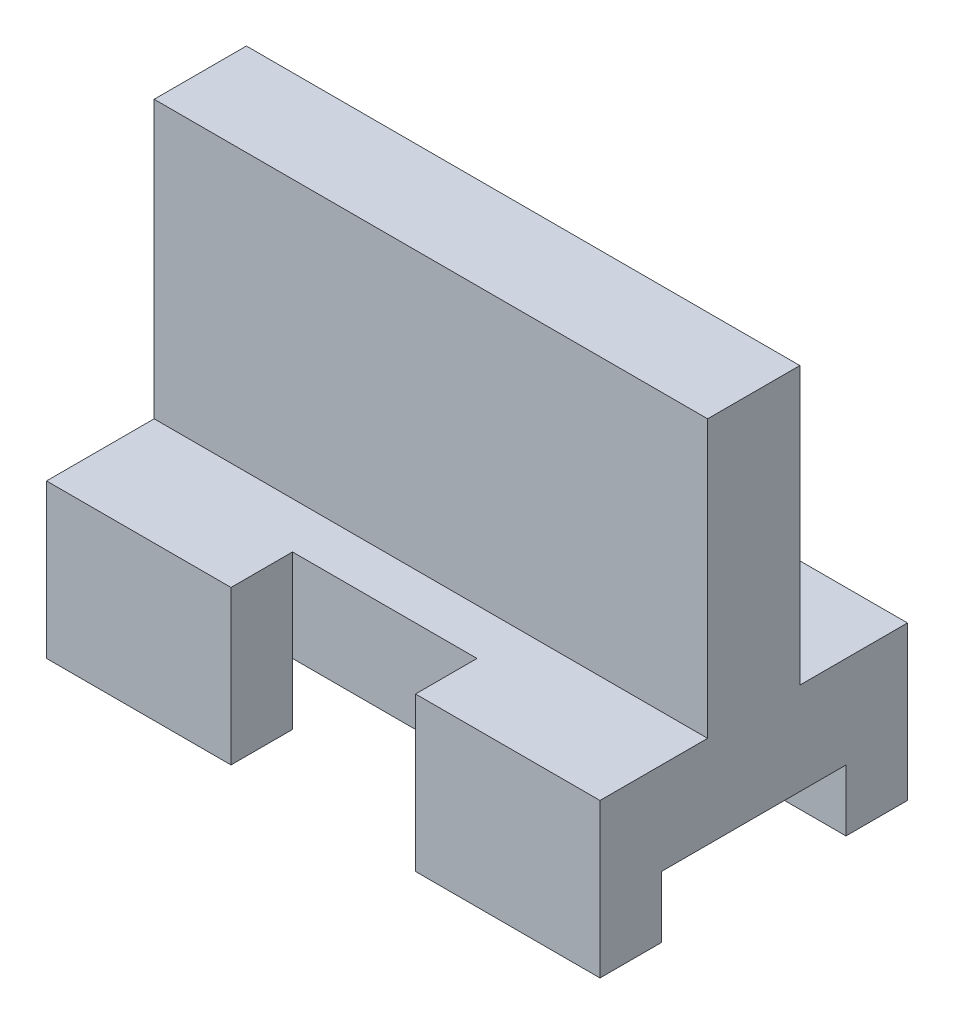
ISO-10303-21;
HEADER;
FILE_DESCRIPTION(('STEP AP214'),'2;1');
FILE_NAME('part.step','',(''),(''),'','','');
FILE_SCHEMA(('AUTOMOTIVE_DESIGN { 1 0 10303 214 1 1 1 1 }'));
ENDSEC;
DATA;
#1=APPLICATION_CONTEXT('core data for automotive mechanical design processes');
#2=APPLICATION_PROTOCOL_DEFINITION('international standard','automotive_design',2000,#1);
#3=PRODUCT_CONTEXT('',#1,'mechanical');
#4=PRODUCT('Part','Part','',(#3));
#5=PRODUCT_RELATED_PRODUCT_CATEGORY('part','',(#4));
#6=PRODUCT_DEFINITION_FORMATION('','',#4);
#7=PRODUCT_DEFINITION_CONTEXT('part definition',#1,'design');
#8=PRODUCT_DEFINITION('design','',#6,#7);
#9=PRODUCT_DEFINITION_SHAPE('','',#8);
#10=(LENGTH_UNIT() NAMED_UNIT(*) SI_UNIT(.MILLI.,.METRE.));
#11=(NAMED_UNIT(*) PLANE_ANGLE_UNIT() SI_UNIT($,.RADIAN.));
#12=(NAMED_UNIT(*) SI_UNIT($,.STERADIAN.) SOLID_ANGLE_UNIT());
#13=UNCERTAINTY_MEASURE_WITH_UNIT(LENGTH_MEASURE(1.E-05),#10,'distance_accuracy_value','');
#14=(GEOMETRIC_REPRESENTATION_CONTEXT(3) GLOBAL_UNCERTAINTY_ASSIGNED_CONTEXT((#13)) GLOBAL_UNIT_ASSIGNED_CONTEXT((#10,
#11,#12)) REPRESENTATION_CONTEXT('',''));
#15=CARTESIAN_POINT('',(0.,0.,0.));
#16=DIRECTION('',(0.,0.,1.));
#17=DIRECTION('',(1.,0.,0.));
#18=AXIS2_PLACEMENT_3D('',#15,#16,#17);
#19=CARTESIAN_POINT('',(0.,0.,-50.));
#20=DIRECTION('',(0.,-1.,0.));
#21=DIRECTION('',(0.,0.,-1.));
#22=AXIS2_PLACEMENT_3D('',#19,#20,#21);
#23=PLANE('',#22);
#24=DIRECTION('',(1.,0.,0.));
#25=VECTOR('',#24,1.);
#26=CARTESIAN_POINT('',(-5.00000000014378E-05,0.,-10.));
#27=LINE('',#26,#25);
#28=CARTESIAN_POINT('',(60.,0.,-10.));
#29=VERTEX_POINT('',#28);
#30=CARTESIAN_POINT('',(90.,0.,-10.));
#31=VERTEX_POINT('',#30);
#32=EDGE_CURVE('E184',#29,#31,#27,.T.);
#33=ORIENTED_EDGE('',*,*,#32,.T.);
#34=DIRECTION('',(0.,0.,-1.));
#35=VECTOR('',#34,1.);
#36=CARTESIAN_POINT('',(90.,0.,0.));
#37=LINE('',#36,#35);
#38=CARTESIAN_POINT('',(90.,0.,0.));
#39=VERTEX_POINT('',#38);
#40=EDGE_CURVE('E198',#39,#31,#37,.T.);
#41=ORIENTED_EDGE('',*,*,#40,.F.);
#42=DIRECTION('',(1.,0.,0.));
#43=VECTOR('',#42,1.);
#44=CARTESIAN_POINT('',(0.,0.,0.));
#45=LINE('',#44,#43);
#46=CARTESIAN_POINT('',(60.,0.,0.));
#47=VERTEX_POINT('',#46);
#48=EDGE_CURVE('E376',#47,#39,#45,.T.);
#49=ORIENTED_EDGE('',*,*,#48,.F.);
#50=DIRECTION('',(0.,0.,-1.));
#51=VECTOR('',#50,1.);
#52=CARTESIAN_POINT('',(60.,0.,0.));
#53=LINE('',#52,#51);
#54=EDGE_CURVE('E199',#47,#29,#53,.T.);
#55=ORIENTED_EDGE('',*,*,#54,.T.);
#56=EDGE_LOOP('',(#33,#41,#49,#55));
#57=FACE_BOUND('',#56,.T.);
#58=ADVANCED_FACE('F31',(#57),#23,.T.);
#59=CARTESIAN_POINT('',(0.,0.,-10.));
#60=VERTEX_POINT('',#59);
#61=CARTESIAN_POINT('',(30.,0.,-10.));
#62=VERTEX_POINT('',#61);
#63=EDGE_CURVE('E200',#60,#62,#27,.T.);
#64=ORIENTED_EDGE('',*,*,#63,.T.);
#65=DIRECTION('',(0.,0.,1.));
#66=VECTOR('',#65,1.);
#67=CARTESIAN_POINT('',(30.,0.,0.));
#68=LINE('',#67,#66);
#69=CARTESIAN_POINT('',(30.,0.,0.));
#70=VERTEX_POINT('',#69);
#71=EDGE_CURVE('E285',#62,#70,#68,.T.);
#72=ORIENTED_EDGE('',*,*,#71,.T.);
#73=CARTESIAN_POINT('',(0.,0.,0.));
#74=VERTEX_POINT('',#73);
#75=EDGE_CURVE('E212',#74,#70,#45,.T.);
#76=ORIENTED_EDGE('',*,*,#75,.F.);
#77=DIRECTION('',(0.,0.,1.));
#78=VECTOR('',#77,1.);
#79=CARTESIAN_POINT('',(0.,0.,0.));
#80=LINE('',#79,#78);
#81=EDGE_CURVE('E327',#60,#74,#80,.T.);
#82=ORIENTED_EDGE('',*,*,#81,.F.);
#83=EDGE_LOOP('',(#64,#72,#76,#82));
#84=FACE_BOUND('',#83,.T.);
#85=ADVANCED_FACE('F446',(#84),#23,.T.);
#86=DIRECTION('',(1.,0.,0.));
#87=VECTOR('',#86,1.);
#88=CARTESIAN_POINT('',(-5.00000000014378E-05,0.,-40.));
#89=LINE('',#88,#87);
#90=CARTESIAN_POINT('',(0.,0.,-40.));
#91=VERTEX_POINT('',#90);
#92=CARTESIAN_POINT('',(30.,0.,-40.));
#93=VERTEX_POINT('',#92);
#94=EDGE_CURVE('E48',#91,#93,#89,.T.);
#95=ORIENTED_EDGE('',*,*,#94,.F.);
#96=CARTESIAN_POINT('',(0.,0.,-50.));
#97=VERTEX_POINT('',#96);
#98=EDGE_CURVE('E377',#97,#91,#80,.T.);
#99=ORIENTED_EDGE('',*,*,#98,.F.);
#100=DIRECTION('',(-1.,0.,0.));
#101=VECTOR('',#100,1.);
#102=CARTESIAN_POINT('',(0.,0.,-50.));
#103=LINE('',#102,#101);
#104=CARTESIAN_POINT('',(30.,0.,-50.));
#105=VERTEX_POINT('',#104);
#106=EDGE_CURVE('E207',#105,#97,#103,.T.);
#107=ORIENTED_EDGE('',*,*,#106,.F.);
#108=DIRECTION('',(0.,0.,1.));
#109=VECTOR('',#108,1.);
#110=CARTESIAN_POINT('',(30.,0.,-50.));
#111=LINE('',#110,#109);
#112=EDGE_CURVE('E388',#105,#93,#111,.T.);
#113=ORIENTED_EDGE('',*,*,#112,.T.);
#114=EDGE_LOOP('',(#95,#99,#107,#113));
#115=FACE_BOUND('',#114,.T.);
#116=ADVANCED_FACE('F386',(#115),#23,.T.);
#117=CARTESIAN_POINT('',(0.,25.,-50.));
#118=DIRECTION('',(0.,0.,1.));
#119=DIRECTION('',(1.,0.,0.));
#120=AXIS2_PLACEMENT_3D('',#117,#118,#119);
#121=PLANE('',#120);
#122=CARTESIAN_POINT('',(90.,0.,-50.));
#123=VERTEX_POINT('',#122);
#124=CARTESIAN_POINT('',(60.,0.,-50.));
#125=VERTEX_POINT('',#124);
#126=EDGE_CURVE('E210',#123,#125,#103,.T.);
#127=ORIENTED_EDGE('',*,*,#126,.T.);
#128=DIRECTION('',(0.,1.,0.));
#129=VECTOR('',#128,1.);
#130=CARTESIAN_POINT('',(60.,0.,-50.));
#131=LINE('',#130,#129);
#132=CARTESIAN_POINT('',(60.,25.,-50.));
#133=VERTEX_POINT('',#132);
#134=EDGE_CURVE('E263',#125,#133,#131,.T.);
#135=ORIENTED_EDGE('',*,*,#134,.T.);
#136=DIRECTION('',(-1.,0.,0.));
#137=VECTOR('',#136,1.);
#138=CARTESIAN_POINT('',(0.,25.,-50.));
#139=LINE('',#138,#137);
#140=CARTESIAN_POINT('',(90.,25.,-50.));
#141=VERTEX_POINT('',#140);
#142=EDGE_CURVE('E222',#141,#133,#139,.T.);
#143=ORIENTED_EDGE('',*,*,#142,.F.);
#144=DIRECTION('',(0.,-1.,0.));
#145=VECTOR('',#144,1.);
#146=CARTESIAN_POINT('',(90.,25.,-50.));
#147=LINE('',#146,#145);
#148=EDGE_CURVE('E221',#141,#123,#147,.T.);
#149=ORIENTED_EDGE('',*,*,#148,.T.);
#150=EDGE_LOOP('',(#127,#135,#143,#149));
#151=FACE_BOUND('',#150,.T.);
#152=ADVANCED_FACE('F262',(#151),#121,.F.);
#153=CARTESIAN_POINT('',(0.,25.,0.));
#154=DIRECTION('',(0.,0.,-1.));
#155=DIRECTION('',(-1.,0.,0.));
#156=AXIS2_PLACEMENT_3D('',#153,#154,#155);
#157=PLANE('',#156);
#158=ORIENTED_EDGE('',*,*,#75,.T.);
#159=DIRECTION('',(0.,1.,0.));
#160=VECTOR('',#159,1.);
#161=CARTESIAN_POINT('',(30.,0.,0.));
#162=LINE('',#161,#160);
#163=CARTESIAN_POINT('',(30.,25.,0.));
#164=VERTEX_POINT('',#163);
#165=EDGE_CURVE('E289',#70,#164,#162,.T.);
#166=ORIENTED_EDGE('',*,*,#165,.T.);
#167=DIRECTION('',(1.,0.,0.));
#168=VECTOR('',#167,1.);
#169=CARTESIAN_POINT('',(0.,25.,0.));
#170=LINE('',#169,#168);
#171=CARTESIAN_POINT('',(0.,25.,0.));
#172=VERTEX_POINT('',#171);
#173=EDGE_CURVE('E236',#172,#164,#170,.T.);
#174=ORIENTED_EDGE('',*,*,#173,.F.);
#175=DIRECTION('',(0.,-1.,0.));
#176=VECTOR('',#175,1.);
#177=CARTESIAN_POINT('',(0.,25.,0.));
#178=LINE('',#177,#176);
#179=EDGE_CURVE('E11',#172,#74,#178,.T.);
#180=ORIENTED_EDGE('',*,*,#179,.T.);
#181=EDGE_LOOP('',(#158,#166,#174,#180));
#182=FACE_BOUND('',#181,.T.);
#183=ADVANCED_FACE('F357',(#182),#157,.F.);
#184=CARTESIAN_POINT('',(0.,25.,-50.));
#185=DIRECTION('',(0.,-1.,0.));
#186=DIRECTION('',(0.,0.,-1.));
#187=AXIS2_PLACEMENT_3D('',#184,#185,#186);
#188=PLANE('',#187);
#189=ORIENTED_EDGE('',*,*,#142,.T.);
#190=DIRECTION('',(0.,0.,-1.));
#191=VECTOR('',#190,1.);
#192=CARTESIAN_POINT('',(60.,25.,-50.));
#193=LINE('',#192,#191);
#194=CARTESIAN_POINT('',(60.,25.,-40.));
#195=VERTEX_POINT('',#194);
#196=EDGE_CURVE('E276',#195,#133,#193,.T.);
#197=ORIENTED_EDGE('',*,*,#196,.F.);
#198=DIRECTION('',(1.,0.,0.));
#199=VECTOR('',#198,1.);
#200=CARTESIAN_POINT('',(30.,25.,-40.));
#201=LINE('',#200,#199);
#202=CARTESIAN_POINT('',(30.,25.,-40.));
#203=VERTEX_POINT('',#202);
#204=EDGE_CURVE('E407',#203,#195,#201,.T.);
#205=ORIENTED_EDGE('',*,*,#204,.F.);
#206=DIRECTION('',(0.,0.,1.));
#207=VECTOR('',#206,1.);
#208=CARTESIAN_POINT('',(30.,25.,-50.));
#209=LINE('',#208,#207);
#210=CARTESIAN_POINT('',(30.,25.,-50.));
#211=VERTEX_POINT('',#210);
#212=EDGE_CURVE('E403',#211,#203,#209,.T.);
#213=ORIENTED_EDGE('',*,*,#212,.F.);
#214=CARTESIAN_POINT('',(0.,25.,-50.));
#215=VERTEX_POINT('',#214);
#216=EDGE_CURVE('E247',#211,#215,#139,.T.);
#217=ORIENTED_EDGE('',*,*,#216,.T.);
#218=DIRECTION('',(0.,0.,1.));
#219=VECTOR('',#218,1.);
#220=CARTESIAN_POINT('',(0.,25.,0.));
#221=LINE('',#220,#219);
#222=CARTESIAN_POINT('',(0.,25.,-32.5));
#223=VERTEX_POINT('',#222);
#224=EDGE_CURVE('E226',#215,#223,#221,.T.);
#225=ORIENTED_EDGE('',*,*,#224,.T.);
#226=DIRECTION('',(-1.,0.,0.));
#227=VECTOR('',#226,1.);
#228=CARTESIAN_POINT('',(0.,25.,-32.5));
#229=LINE('',#228,#227);
#230=CARTESIAN_POINT('',(90.,25.,-32.5));
#231=VERTEX_POINT('',#230);
#232=EDGE_CURVE('E56',#231,#223,#229,.T.);
#233=ORIENTED_EDGE('',*,*,#232,.F.);
#234=DIRECTION('',(0.,0.,-1.));
#235=VECTOR('',#234,1.);
#236=CARTESIAN_POINT('',(90.,25.,0.));
#237=LINE('',#236,#235);
#238=EDGE_CURVE('E240',#231,#141,#237,.T.);
#239=ORIENTED_EDGE('',*,*,#238,.T.);
#240=EDGE_LOOP('',(#189,#197,#205,#213,#217,#225,#233,#239));
#241=FACE_BOUND('',#240,.T.);
#242=ADVANCED_FACE('F252',(#241),#188,.F.);
#243=ORIENTED_EDGE('',*,*,#173,.T.);
#244=DIRECTION('',(0.,0.,1.));
#245=VECTOR('',#244,1.);
#246=CARTESIAN_POINT('',(30.,25.,0.));
#247=LINE('',#246,#245);
#248=CARTESIAN_POINT('',(30.,25.,-10.));
#249=VERTEX_POINT('',#248);
#250=EDGE_CURVE('E267',#249,#164,#247,.T.);
#251=ORIENTED_EDGE('',*,*,#250,.F.);
#252=DIRECTION('',(-1.,0.,0.));
#253=VECTOR('',#252,1.);
#254=CARTESIAN_POINT('',(30.,25.,-10.));
#255=LINE('',#254,#253);
#256=CARTESIAN_POINT('',(60.,25.,-10.));
#257=VERTEX_POINT('',#256);
#258=EDGE_CURVE('E288',#257,#249,#255,.T.);
#259=ORIENTED_EDGE('',*,*,#258,.F.);
#260=DIRECTION('',(0.,0.,-1.));
#261=VECTOR('',#260,1.);
#262=CARTESIAN_POINT('',(60.,25.,0.));
#263=LINE('',#262,#261);
#264=CARTESIAN_POINT('',(60.,25.,0.));
#265=VERTEX_POINT('',#264);
#266=EDGE_CURVE('E270',#265,#257,#263,.T.);
#267=ORIENTED_EDGE('',*,*,#266,.F.);
#268=CARTESIAN_POINT('',(90.,25.,0.));
#269=VERTEX_POINT('',#268);
#270=EDGE_CURVE('E229',#265,#269,#170,.T.);
#271=ORIENTED_EDGE('',*,*,#270,.T.);
#272=CARTESIAN_POINT('',(90.,25.,-17.5));
#273=VERTEX_POINT('',#272);
#274=EDGE_CURVE('E246',#269,#273,#237,.T.);
#275=ORIENTED_EDGE('',*,*,#274,.T.);
#276=DIRECTION('',(1.,0.,0.));
#277=VECTOR('',#276,1.);
#278=CARTESIAN_POINT('',(0.,25.,-17.5));
#279=LINE('',#278,#277);
#280=CARTESIAN_POINT('',(0.,25.,-17.5));
#281=VERTEX_POINT('',#280);
#282=EDGE_CURVE('E298',#281,#273,#279,.T.);
#283=ORIENTED_EDGE('',*,*,#282,.F.);
#284=EDGE_CURVE('E217',#281,#172,#221,.T.);
#285=ORIENTED_EDGE('',*,*,#284,.T.);
#286=EDGE_LOOP('',(#243,#251,#259,#267,#271,#275,#283,#285));
#287=FACE_BOUND('',#286,.T.);
#288=ADVANCED_FACE('F347',(#287),#188,.F.);
#289=CARTESIAN_POINT('',(0.,25.,0.));
#290=DIRECTION('',(1.,0.,0.));
#291=DIRECTION('',(0.,0.,-1.));
#292=AXIS2_PLACEMENT_3D('',#289,#290,#291);
#293=PLANE('',#292);
#294=DIRECTION('',(0.,0.,1.));
#295=VECTOR('',#294,1.);
#296=CARTESIAN_POINT('',(0.,10.,0.));
#297=LINE('',#296,#295);
#298=CARTESIAN_POINT('',(0.,10.,-40.));
#299=VERTEX_POINT('',#298);
#300=CARTESIAN_POINT('',(0.,10.,-10.));
#301=VERTEX_POINT('',#300);
#302=EDGE_CURVE('E398',#299,#301,#297,.T.);
#303=ORIENTED_EDGE('',*,*,#302,.T.);
#304=DIRECTION('',(0.,-1.,0.));
#305=VECTOR('',#304,1.);
#306=CARTESIAN_POINT('',(0.,25.,-10.));
#307=LINE('',#306,#305);
#308=EDGE_CURVE('E401',#301,#60,#307,.T.);
#309=ORIENTED_EDGE('',*,*,#308,.T.);
#310=ORIENTED_EDGE('',*,*,#81,.T.);
#311=ORIENTED_EDGE('',*,*,#179,.F.);
#312=ORIENTED_EDGE('',*,*,#284,.F.);
#313=DIRECTION('',(0.,-1.,0.));
#314=VECTOR('',#313,1.);
#315=CARTESIAN_POINT('',(0.,70.,-17.5));
#316=LINE('',#315,#314);
#317=CARTESIAN_POINT('',(0.,70.,-17.5));
#318=VERTEX_POINT('',#317);
#319=EDGE_CURVE('E321',#318,#281,#316,.T.);
#320=ORIENTED_EDGE('',*,*,#319,.F.);
#321=DIRECTION('',(0.,0.,1.));
#322=VECTOR('',#321,1.);
#323=CARTESIAN_POINT('',(0.,70.,-32.5));
#324=LINE('',#323,#322);
#325=CARTESIAN_POINT('',(0.,70.,-32.5));
#326=VERTEX_POINT('',#325);
#327=EDGE_CURVE('E307',#326,#318,#324,.T.);
#328=ORIENTED_EDGE('',*,*,#327,.F.);
#329=DIRECTION('',(0.,-1.,0.));
#330=VECTOR('',#329,1.);
#331=CARTESIAN_POINT('',(0.,70.,-32.5));
#332=LINE('',#331,#330);
#333=EDGE_CURVE('E315',#326,#223,#332,.T.);
#334=ORIENTED_EDGE('',*,*,#333,.T.);
#335=ORIENTED_EDGE('',*,*,#224,.F.);
#336=DIRECTION('',(0.,-1.,0.));
#337=VECTOR('',#336,1.);
#338=CARTESIAN_POINT('',(0.,25.,-50.));
#339=LINE('',#338,#337);
#340=EDGE_CURVE('E218',#215,#97,#339,.T.);
#341=ORIENTED_EDGE('',*,*,#340,.T.);
#342=ORIENTED_EDGE('',*,*,#98,.T.);
#343=DIRECTION('',(0.,1.,0.));
#344=VECTOR('',#343,1.);
#345=CARTESIAN_POINT('',(0.,25.,-40.));
#346=LINE('',#345,#344);
#347=EDGE_CURVE('E381',#91,#299,#346,.T.);
#348=ORIENTED_EDGE('',*,*,#347,.T.);
#349=EDGE_LOOP('',(#303,#309,#310,#311,#312,#320,#328,#334,#335,#341,#342,#348));
#350=FACE_BOUND('',#349,.T.);
#351=ADVANCED_FACE('F33',(#350),#293,.F.);
#352=ORIENTED_EDGE('',*,*,#270,.F.);
#353=DIRECTION('',(0.,1.,0.));
#354=VECTOR('',#353,1.);
#355=CARTESIAN_POINT('',(60.,0.,0.));
#356=LINE('',#355,#354);
#357=EDGE_CURVE('E303',#47,#265,#356,.T.);
#358=ORIENTED_EDGE('',*,*,#357,.F.);
#359=ORIENTED_EDGE('',*,*,#48,.T.);
#360=DIRECTION('',(0.,-1.,0.));
#361=VECTOR('',#360,1.);
#362=CARTESIAN_POINT('',(90.,25.,0.));
#363=LINE('',#362,#361);
#364=EDGE_CURVE('E40',#269,#39,#363,.T.);
#365=ORIENTED_EDGE('',*,*,#364,.F.);
#366=EDGE_LOOP('',(#352,#358,#359,#365));
#367=FACE_BOUND('',#366,.T.);
#368=ADVANCED_FACE('F375',(#367),#157,.F.);
#369=CARTESIAN_POINT('',(90.,25.,0.));
#370=DIRECTION('',(-1.,0.,0.));
#371=DIRECTION('',(0.,0.,1.));
#372=AXIS2_PLACEMENT_3D('',#369,#370,#371);
#373=PLANE('',#372);
#374=ORIENTED_EDGE('',*,*,#40,.T.);
#375=DIRECTION('',(0.,-1.,0.));
#376=VECTOR('',#375,1.);
#377=CARTESIAN_POINT('',(90.,0.,-10.));
#378=LINE('',#377,#376);
#379=CARTESIAN_POINT('',(90.,10.,-10.));
#380=VERTEX_POINT('',#379);
#381=EDGE_CURVE('E181',#380,#31,#378,.T.);
#382=ORIENTED_EDGE('',*,*,#381,.F.);
#383=DIRECTION('',(0.,0.,1.));
#384=VECTOR('',#383,1.);
#385=CARTESIAN_POINT('',(90.,10.,-10.));
#386=LINE('',#385,#384);
#387=CARTESIAN_POINT('',(90.,10.,-40.));
#388=VERTEX_POINT('',#387);
#389=EDGE_CURVE('E201',#388,#380,#386,.T.);
#390=ORIENTED_EDGE('',*,*,#389,.F.);
#391=DIRECTION('',(0.,1.,0.));
#392=VECTOR('',#391,1.);
#393=CARTESIAN_POINT('',(90.,0.,-40.));
#394=LINE('',#393,#392);
#395=CARTESIAN_POINT('',(90.,0.,-40.));
#396=VERTEX_POINT('',#395);
#397=EDGE_CURVE('E192',#396,#388,#394,.T.);
#398=ORIENTED_EDGE('',*,*,#397,.F.);
#399=EDGE_CURVE('E208',#396,#123,#37,.T.);
#400=ORIENTED_EDGE('',*,*,#399,.T.);
#401=ORIENTED_EDGE('',*,*,#148,.F.);
#402=ORIENTED_EDGE('',*,*,#238,.F.);
#403=DIRECTION('',(0.,-1.,0.));
#404=VECTOR('',#403,1.);
#405=CARTESIAN_POINT('',(90.,70.,-32.5));
#406=LINE('',#405,#404);
#407=CARTESIAN_POINT('',(90.,70.,-32.5));
#408=VERTEX_POINT('',#407);
#409=EDGE_CURVE('E322',#408,#231,#406,.T.);
#410=ORIENTED_EDGE('',*,*,#409,.F.);
#411=DIRECTION('',(0.,0.,-1.));
#412=VECTOR('',#411,1.);
#413=CARTESIAN_POINT('',(90.,70.,-32.5));
#414=LINE('',#413,#412);
#415=CARTESIAN_POINT('',(90.,70.,-17.5));
#416=VERTEX_POINT('',#415);
#417=EDGE_CURVE('E312',#416,#408,#414,.T.);
#418=ORIENTED_EDGE('',*,*,#417,.F.);
#419=DIRECTION('',(0.,-1.,0.));
#420=VECTOR('',#419,1.);
#421=CARTESIAN_POINT('',(90.,70.,-17.5));
#422=LINE('',#421,#420);
#423=EDGE_CURVE('E318',#416,#273,#422,.T.);
#424=ORIENTED_EDGE('',*,*,#423,.T.);
#425=ORIENTED_EDGE('',*,*,#274,.F.);
#426=ORIENTED_EDGE('',*,*,#364,.T.);
#427=EDGE_LOOP('',(#374,#382,#390,#398,#400,#401,#402,#410,#418,#424,#425,#426));
#428=FACE_BOUND('',#427,.T.);
#429=ADVANCED_FACE('F204',(#428),#373,.F.);
#430=ORIENTED_EDGE('',*,*,#216,.F.);
#431=DIRECTION('',(0.,1.,0.));
#432=VECTOR('',#431,1.);
#433=CARTESIAN_POINT('',(30.,0.,-50.));
#434=LINE('',#433,#432);
#435=EDGE_CURVE('E282',#105,#211,#434,.T.);
#436=ORIENTED_EDGE('',*,*,#435,.F.);
#437=ORIENTED_EDGE('',*,*,#106,.T.);
#438=ORIENTED_EDGE('',*,*,#340,.F.);
#439=EDGE_LOOP('',(#430,#436,#437,#438));
#440=FACE_BOUND('',#439,.T.);
#441=ADVANCED_FACE('F419',(#440),#121,.F.);
#442=CARTESIAN_POINT('',(60.,0.,-40.));
#443=VERTEX_POINT('',#442);
#444=EDGE_CURVE('E390',#443,#396,#89,.T.);
#445=ORIENTED_EDGE('',*,*,#444,.F.);
#446=DIRECTION('',(0.,0.,-1.));
#447=VECTOR('',#446,1.);
#448=CARTESIAN_POINT('',(60.,0.,-50.));
#449=LINE('',#448,#447);
#450=EDGE_CURVE('E284',#443,#125,#449,.T.);
#451=ORIENTED_EDGE('',*,*,#450,.T.);
#452=ORIENTED_EDGE('',*,*,#126,.F.);
#453=ORIENTED_EDGE('',*,*,#399,.F.);
#454=EDGE_LOOP('',(#445,#451,#452,#453));
#455=FACE_BOUND('',#454,.T.);
#456=ADVANCED_FACE('F435',(#455),#23,.T.);
#457=CARTESIAN_POINT('',(0.,70.,-17.5));
#458=DIRECTION('',(0.,0.,-1.));
#459=DIRECTION('',(-1.,0.,0.));
#460=AXIS2_PLACEMENT_3D('',#457,#458,#459);
#461=PLANE('',#460);
#462=ORIENTED_EDGE('',*,*,#282,.T.);
#463=ORIENTED_EDGE('',*,*,#423,.F.);
#464=DIRECTION('',(1.,0.,0.));
#465=VECTOR('',#464,1.);
#466=CARTESIAN_POINT('',(0.,70.,-17.5));
#467=LINE('',#466,#465);
#468=EDGE_CURVE('E310',#318,#416,#467,.T.);
#469=ORIENTED_EDGE('',*,*,#468,.F.);
#470=ORIENTED_EDGE('',*,*,#319,.T.);
#471=EDGE_LOOP('',(#462,#463,#469,#470));
#472=FACE_BOUND('',#471,.T.);
#473=ADVANCED_FACE('F345',(#472),#461,.F.);
#474=CARTESIAN_POINT('',(0.,70.,-32.5));
#475=DIRECTION('',(0.,0.,1.));
#476=DIRECTION('',(1.,0.,0.));
#477=AXIS2_PLACEMENT_3D('',#474,#475,#476);
#478=PLANE('',#477);
#479=ORIENTED_EDGE('',*,*,#232,.T.);
#480=ORIENTED_EDGE('',*,*,#333,.F.);
#481=DIRECTION('',(-1.,0.,0.));
#482=VECTOR('',#481,1.);
#483=CARTESIAN_POINT('',(0.,70.,-32.5));
#484=LINE('',#483,#482);
#485=EDGE_CURVE('E314',#408,#326,#484,.T.);
#486=ORIENTED_EDGE('',*,*,#485,.F.);
#487=ORIENTED_EDGE('',*,*,#409,.T.);
#488=EDGE_LOOP('',(#479,#480,#486,#487));
#489=FACE_BOUND('',#488,.T.);
#490=ADVANCED_FACE('F336',(#489),#478,.F.);
#491=CARTESIAN_POINT('',(0.,70.,-32.5));
#492=DIRECTION('',(0.,1.,0.));
#493=DIRECTION('',(0.,0.,1.));
#494=AXIS2_PLACEMENT_3D('',#491,#492,#493);
#495=PLANE('',#494);
#496=ORIENTED_EDGE('',*,*,#327,.T.);
#497=ORIENTED_EDGE('',*,*,#468,.T.);
#498=ORIENTED_EDGE('',*,*,#417,.T.);
#499=ORIENTED_EDGE('',*,*,#485,.T.);
#500=EDGE_LOOP('',(#496,#497,#498,#499));
#501=FACE_BOUND('',#500,.T.);
#502=ADVANCED_FACE('F341',(#501),#495,.T.);
#503=CARTESIAN_POINT('',(30.,0.,0.));
#504=DIRECTION('',(-1.,0.,0.));
#505=DIRECTION('',(0.,0.,1.));
#506=AXIS2_PLACEMENT_3D('',#503,#504,#505);
#507=PLANE('',#506);
#508=ORIENTED_EDGE('',*,*,#250,.T.);
#509=ORIENTED_EDGE('',*,*,#165,.F.);
#510=ORIENTED_EDGE('',*,*,#71,.F.);
#511=DIRECTION('',(0.,1.,0.));
#512=VECTOR('',#511,1.);
#513=CARTESIAN_POINT('',(30.,0.,-10.));
#514=LINE('',#513,#512);
#515=CARTESIAN_POINT('',(30.,10.,-10.));
#516=VERTEX_POINT('',#515);
#517=EDGE_CURVE('E295',#62,#516,#514,.T.);
#518=ORIENTED_EDGE('',*,*,#517,.T.);
#519=EDGE_CURVE('E299',#516,#249,#514,.T.);
#520=ORIENTED_EDGE('',*,*,#519,.T.);
#521=EDGE_LOOP('',(#508,#509,#510,#518,#520));
#522=FACE_BOUND('',#521,.T.);
#523=ADVANCED_FACE('F362',(#522),#507,.F.);
#524=CARTESIAN_POINT('',(30.,0.,-10.));
#525=DIRECTION('',(0.,0.,-1.));
#526=DIRECTION('',(-1.,0.,0.));
#527=AXIS2_PLACEMENT_3D('',#524,#525,#526);
#528=PLANE('',#527);
#529=ORIENTED_EDGE('',*,*,#519,.F.);
#530=DIRECTION('',(1.,0.,0.));
#531=VECTOR('',#530,1.);
#532=CARTESIAN_POINT('',(-5.00000000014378E-05,10.,-10.));
#533=LINE('',#532,#531);
#534=CARTESIAN_POINT('',(60.,10.,-10.));
#535=VERTEX_POINT('',#534);
#536=EDGE_CURVE('E369',#516,#535,#533,.T.);
#537=ORIENTED_EDGE('',*,*,#536,.T.);
#538=DIRECTION('',(0.,1.,0.));
#539=VECTOR('',#538,1.);
#540=CARTESIAN_POINT('',(60.,0.,-10.));
#541=LINE('',#540,#539);
#542=EDGE_CURVE('E302',#535,#257,#541,.T.);
#543=ORIENTED_EDGE('',*,*,#542,.T.);
#544=ORIENTED_EDGE('',*,*,#258,.T.);
#545=EDGE_LOOP('',(#529,#537,#543,#544));
#546=FACE_BOUND('',#545,.T.);
#547=ADVANCED_FACE('F367',(#546),#528,.F.);
#548=CARTESIAN_POINT('',(60.,0.,0.));
#549=DIRECTION('',(1.,0.,0.));
#550=DIRECTION('',(0.,0.,-1.));
#551=AXIS2_PLACEMENT_3D('',#548,#549,#550);
#552=PLANE('',#551);
#553=ORIENTED_EDGE('',*,*,#266,.T.);
#554=ORIENTED_EDGE('',*,*,#542,.F.);
#555=EDGE_CURVE('E300',#29,#535,#541,.T.);
#556=ORIENTED_EDGE('',*,*,#555,.F.);
#557=ORIENTED_EDGE('',*,*,#54,.F.);
#558=ORIENTED_EDGE('',*,*,#357,.T.);
#559=EDGE_LOOP('',(#553,#554,#556,#557,#558));
#560=FACE_BOUND('',#559,.T.);
#561=ADVANCED_FACE('F371',(#560),#552,.F.);
#562=CARTESIAN_POINT('',(60.,0.,-50.));
#563=DIRECTION('',(1.,0.,0.));
#564=DIRECTION('',(0.,0.,-1.));
#565=AXIS2_PLACEMENT_3D('',#562,#563,#564);
#566=PLANE('',#565);
#567=ORIENTED_EDGE('',*,*,#196,.T.);
#568=ORIENTED_EDGE('',*,*,#134,.F.);
#569=ORIENTED_EDGE('',*,*,#450,.F.);
#570=DIRECTION('',(0.,1.,0.));
#571=VECTOR('',#570,1.);
#572=CARTESIAN_POINT('',(60.,0.,-40.));
#573=LINE('',#572,#571);
#574=CARTESIAN_POINT('',(60.,10.,-40.));
#575=VERTEX_POINT('',#574);
#576=EDGE_CURVE('E268',#443,#575,#573,.T.);
#577=ORIENTED_EDGE('',*,*,#576,.T.);
#578=EDGE_CURVE('E273',#575,#195,#573,.T.);
#579=ORIENTED_EDGE('',*,*,#578,.T.);
#580=EDGE_LOOP('',(#567,#568,#569,#577,#579));
#581=FACE_BOUND('',#580,.T.);
#582=ADVANCED_FACE('F412',(#581),#566,.F.);
#583=CARTESIAN_POINT('',(30.,0.,-40.));
#584=DIRECTION('',(0.,0.,1.));
#585=DIRECTION('',(1.,0.,0.));
#586=AXIS2_PLACEMENT_3D('',#583,#584,#585);
#587=PLANE('',#586);
#588=ORIENTED_EDGE('',*,*,#578,.F.);
#589=DIRECTION('',(1.,0.,0.));
#590=VECTOR('',#589,1.);
#591=CARTESIAN_POINT('',(-5.00000000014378E-05,10.,-40.));
#592=LINE('',#591,#590);
#593=CARTESIAN_POINT('',(30.,10.,-40.));
#594=VERTEX_POINT('',#593);
#595=EDGE_CURVE('E392',#594,#575,#592,.T.);
#596=ORIENTED_EDGE('',*,*,#595,.F.);
#597=DIRECTION('',(0.,1.,0.));
#598=VECTOR('',#597,1.);
#599=CARTESIAN_POINT('',(30.,0.,-40.));
#600=LINE('',#599,#598);
#601=EDGE_CURVE('E281',#594,#203,#600,.T.);
#602=ORIENTED_EDGE('',*,*,#601,.T.);
#603=ORIENTED_EDGE('',*,*,#204,.T.);
#604=EDGE_LOOP('',(#588,#596,#602,#603));
#605=FACE_BOUND('',#604,.T.);
#606=ADVANCED_FACE('F429',(#605),#587,.F.);
#607=CARTESIAN_POINT('',(30.,0.,-50.));
#608=DIRECTION('',(-1.,0.,0.));
#609=DIRECTION('',(0.,0.,1.));
#610=AXIS2_PLACEMENT_3D('',#607,#608,#609);
#611=PLANE('',#610);
#612=ORIENTED_EDGE('',*,*,#212,.T.);
#613=ORIENTED_EDGE('',*,*,#601,.F.);
#614=EDGE_CURVE('E279',#93,#594,#600,.T.);
#615=ORIENTED_EDGE('',*,*,#614,.F.);
#616=ORIENTED_EDGE('',*,*,#112,.F.);
#617=ORIENTED_EDGE('',*,*,#435,.T.);
#618=EDGE_LOOP('',(#612,#613,#615,#616,#617));
#619=FACE_BOUND('',#618,.T.);
#620=ADVANCED_FACE('F420',(#619),#611,.F.);
#621=CARTESIAN_POINT('',(-5.00000000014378E-05,0.,-10.));
#622=DIRECTION('',(0.,0.,1.));
#623=DIRECTION('',(1.,0.,0.));
#624=AXIS2_PLACEMENT_3D('',#621,#622,#623);
#625=PLANE('',#624);
#626=EDGE_CURVE('E399',#301,#516,#533,.T.);
#627=ORIENTED_EDGE('',*,*,#626,.T.);
#628=ORIENTED_EDGE('',*,*,#517,.F.);
#629=ORIENTED_EDGE('',*,*,#63,.F.);
#630=ORIENTED_EDGE('',*,*,#308,.F.);
#631=EDGE_LOOP('',(#627,#628,#629,#630));
#632=FACE_BOUND('',#631,.T.);
#633=ADVANCED_FACE('F458',(#632),#625,.F.);
#634=EDGE_CURVE('E187',#535,#380,#533,.T.);
#635=ORIENTED_EDGE('',*,*,#634,.T.);
#636=ORIENTED_EDGE('',*,*,#381,.T.);
#637=ORIENTED_EDGE('',*,*,#32,.F.);
#638=ORIENTED_EDGE('',*,*,#555,.T.);
#639=EDGE_LOOP('',(#635,#636,#637,#638));
#640=FACE_BOUND('',#639,.T.);
#641=ADVANCED_FACE('F183',(#640),#625,.F.);
#642=CARTESIAN_POINT('',(-5.00000000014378E-05,10.,-10.));
#643=DIRECTION('',(0.,1.,0.));
#644=DIRECTION('',(0.,0.,1.));
#645=AXIS2_PLACEMENT_3D('',#642,#643,#644);
#646=PLANE('',#645);
#647=EDGE_CURVE('E394',#299,#594,#592,.T.);
#648=ORIENTED_EDGE('',*,*,#647,.T.);
#649=ORIENTED_EDGE('',*,*,#595,.T.);
#650=EDGE_CURVE('E389',#575,#388,#592,.T.);
#651=ORIENTED_EDGE('',*,*,#650,.T.);
#652=ORIENTED_EDGE('',*,*,#389,.T.);
#653=ORIENTED_EDGE('',*,*,#634,.F.);
#654=ORIENTED_EDGE('',*,*,#536,.F.);
#655=ORIENTED_EDGE('',*,*,#626,.F.);
#656=ORIENTED_EDGE('',*,*,#302,.F.);
#657=EDGE_LOOP('',(#648,#649,#651,#652,#653,#654,#655,#656));
#658=FACE_BOUND('',#657,.T.);
#659=ADVANCED_FACE('F427',(#658),#646,.F.);
#660=CARTESIAN_POINT('',(-5.00000000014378E-05,0.,-40.));
#661=DIRECTION('',(0.,0.,-1.));
#662=DIRECTION('',(-1.,0.,0.));
#663=AXIS2_PLACEMENT_3D('',#660,#661,#662);
#664=PLANE('',#663);
#665=ORIENTED_EDGE('',*,*,#94,.T.);
#666=ORIENTED_EDGE('',*,*,#614,.T.);
#667=ORIENTED_EDGE('',*,*,#647,.F.);
#668=ORIENTED_EDGE('',*,*,#347,.F.);
#669=EDGE_LOOP('',(#665,#666,#667,#668));
#670=FACE_BOUND('',#669,.T.);
#671=ADVANCED_FACE('F423',(#670),#664,.F.);
#672=ORIENTED_EDGE('',*,*,#444,.T.);
#673=ORIENTED_EDGE('',*,*,#397,.T.);
#674=ORIENTED_EDGE('',*,*,#650,.F.);
#675=ORIENTED_EDGE('',*,*,#576,.F.);
#676=EDGE_LOOP('',(#672,#673,#674,#675));
#677=FACE_BOUND('',#676,.T.);
#678=ADVANCED_FACE('F432',(#677),#664,.F.);
#679=CLOSED_SHELL('',(#58,#85,#116,#152,#183,#242,#288,#351,#368,#429,#441,#456,#473,#490,#502,
#523,#547,#561,#582,#606,#620,#633,#641,#659,#671,#678));
#680=MANIFOLD_SOLID_BREP('B2',#679);
#681=ADVANCED_BREP_SHAPE_REPRESENTATION('',(#18,#680),#14);
#682=SHAPE_DEFINITION_REPRESENTATION(#9,#681);
ENDSEC;
END-ISO-10303-21;
